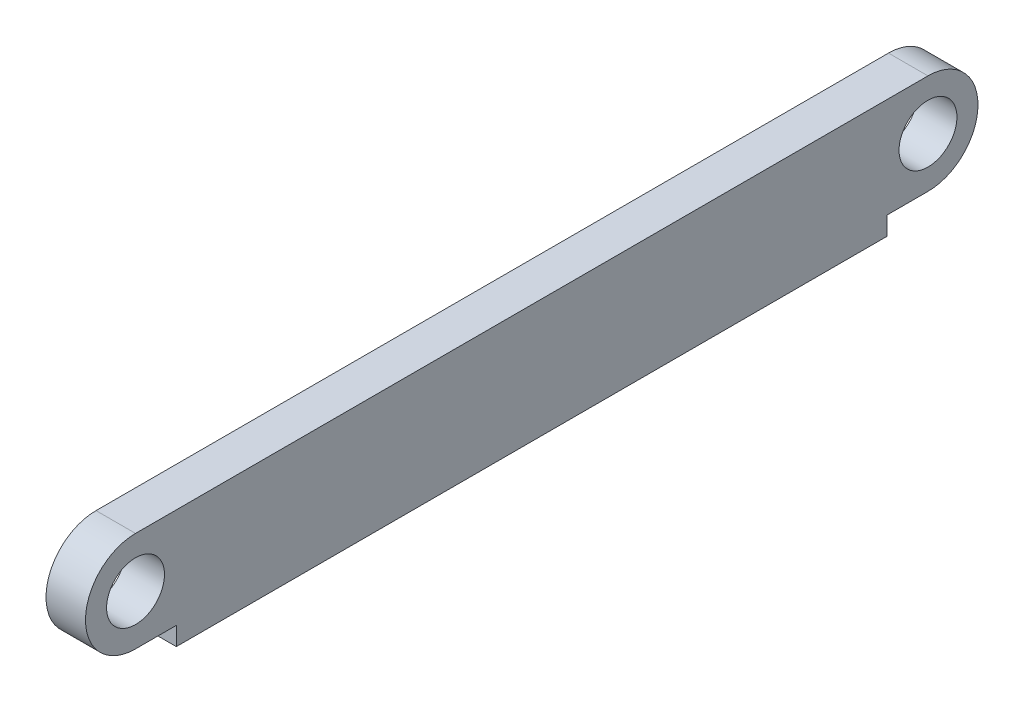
ISO-10303-21;
HEADER;
FILE_DESCRIPTION(('STEP AP214'),'2;1');
FILE_NAME('part.step','',(''),(''),'','','');
FILE_SCHEMA(('AUTOMOTIVE_DESIGN { 1 0 10303 214 1 1 1 1 }'));
ENDSEC;
DATA;
#1=APPLICATION_CONTEXT('core data for automotive mechanical design processes');
#2=APPLICATION_PROTOCOL_DEFINITION('international standard','automotive_design',2000,#1);
#3=PRODUCT_CONTEXT('',#1,'mechanical');
#4=PRODUCT('Part','Part','',(#3));
#5=PRODUCT_RELATED_PRODUCT_CATEGORY('part','',(#4));
#6=PRODUCT_DEFINITION_FORMATION('','',#4);
#7=PRODUCT_DEFINITION_CONTEXT('part definition',#1,'design');
#8=PRODUCT_DEFINITION('design','',#6,#7);
#9=PRODUCT_DEFINITION_SHAPE('','',#8);
#10=(LENGTH_UNIT() NAMED_UNIT(*) SI_UNIT(.MILLI.,.METRE.));
#11=(NAMED_UNIT(*) PLANE_ANGLE_UNIT() SI_UNIT($,.RADIAN.));
#12=(NAMED_UNIT(*) SI_UNIT($,.STERADIAN.) SOLID_ANGLE_UNIT());
#13=UNCERTAINTY_MEASURE_WITH_UNIT(LENGTH_MEASURE(1.E-05),#10,'distance_accuracy_value','');
#14=(GEOMETRIC_REPRESENTATION_CONTEXT(3) GLOBAL_UNCERTAINTY_ASSIGNED_CONTEXT((#13)) GLOBAL_UNIT_ASSIGNED_CONTEXT((#10,
#11,#12)) REPRESENTATION_CONTEXT('',''));
#15=CARTESIAN_POINT('',(0.,0.,0.));
#16=DIRECTION('',(0.,0.,1.));
#17=DIRECTION('',(1.,0.,0.));
#18=AXIS2_PLACEMENT_3D('',#15,#16,#17);
#19=CARTESIAN_POINT('',(3.,-5.50000000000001,-35.5));
#20=DIRECTION('',(0.,0.,1.));
#21=DIRECTION('',(1.,0.,0.));
#22=AXIS2_PLACEMENT_3D('',#19,#20,#21);
#23=PLANE('',#22);
#24=DIRECTION('',(-1.,0.,0.));
#25=VECTOR('',#24,1.);
#26=CARTESIAN_POINT('',(3.,-4.1,-35.5));
#27=LINE('',#26,#25);
#28=CARTESIAN_POINT('',(3.,-4.1,-35.5));
#29=VERTEX_POINT('',#28);
#30=CARTESIAN_POINT('',(0.,-4.1,-35.5));
#31=VERTEX_POINT('',#30);
#32=EDGE_CURVE('E56',#29,#31,#27,.T.);
#33=ORIENTED_EDGE('',*,*,#32,.F.);
#34=DIRECTION('',(0.,1.,0.));
#35=VECTOR('',#34,1.);
#36=CARTESIAN_POINT('',(3.,-5.50000000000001,-35.5));
#37=LINE('',#36,#35);
#38=CARTESIAN_POINT('',(3.,-5.50000000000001,-35.5));
#39=VERTEX_POINT('',#38);
#40=EDGE_CURVE('E217',#39,#29,#37,.T.);
#41=ORIENTED_EDGE('',*,*,#40,.F.);
#42=DIRECTION('',(-1.,0.,0.));
#43=VECTOR('',#42,1.);
#44=CARTESIAN_POINT('',(3.,-5.50000000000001,-35.5));
#45=LINE('',#44,#43);
#46=CARTESIAN_POINT('',(0.,-5.50000000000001,-35.5));
#47=VERTEX_POINT('',#46);
#48=EDGE_CURVE('E41',#39,#47,#45,.T.);
#49=ORIENTED_EDGE('',*,*,#48,.T.);
#50=DIRECTION('',(0.,1.,0.));
#51=VECTOR('',#50,1.);
#52=CARTESIAN_POINT('',(0.,-5.50000000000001,-35.5));
#53=LINE('',#52,#51);
#54=EDGE_CURVE('E224',#47,#31,#53,.T.);
#55=ORIENTED_EDGE('',*,*,#54,.T.);
#56=EDGE_LOOP('',(#33,#41,#49,#55));
#57=FACE_BOUND('',#56,.T.);
#58=ADVANCED_FACE('F33',(#57),#23,.F.);
#59=CARTESIAN_POINT('',(3.,3.5,18.5));
#60=DIRECTION('',(0.,0.,-1.));
#61=DIRECTION('',(-1.,0.,0.));
#62=AXIS2_PLACEMENT_3D('',#59,#60,#61);
#63=PLANE('',#62);
#64=DIRECTION('',(1.,0.,0.));
#65=VECTOR('',#64,1.);
#66=CARTESIAN_POINT('',(3.,-4.1,18.5));
#67=LINE('',#66,#65);
#68=CARTESIAN_POINT('',(0.,-4.1,18.5));
#69=VERTEX_POINT('',#68);
#70=CARTESIAN_POINT('',(3.,-4.1,18.5));
#71=VERTEX_POINT('',#70);
#72=EDGE_CURVE('E208',#69,#71,#67,.T.);
#73=ORIENTED_EDGE('',*,*,#72,.F.);
#74=DIRECTION('',(0.,-1.,0.));
#75=VECTOR('',#74,1.);
#76=CARTESIAN_POINT('',(0.,3.5,18.5));
#77=LINE('',#76,#75);
#78=CARTESIAN_POINT('',(0.,-5.50000000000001,18.5));
#79=VERTEX_POINT('',#78);
#80=EDGE_CURVE('E211',#69,#79,#77,.T.);
#81=ORIENTED_EDGE('',*,*,#80,.T.);
#82=DIRECTION('',(-1.,0.,0.));
#83=VECTOR('',#82,1.);
#84=CARTESIAN_POINT('',(3.,-5.50000000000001,18.5));
#85=LINE('',#84,#83);
#86=CARTESIAN_POINT('',(3.,-5.50000000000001,18.5));
#87=VERTEX_POINT('',#86);
#88=EDGE_CURVE('E11',#87,#79,#85,.T.);
#89=ORIENTED_EDGE('',*,*,#88,.F.);
#90=DIRECTION('',(0.,-1.,0.));
#91=VECTOR('',#90,1.);
#92=CARTESIAN_POINT('',(3.,3.5,18.5));
#93=LINE('',#92,#91);
#94=EDGE_CURVE('E212',#71,#87,#93,.T.);
#95=ORIENTED_EDGE('',*,*,#94,.F.);
#96=EDGE_LOOP('',(#73,#81,#89,#95));
#97=FACE_BOUND('',#96,.T.);
#98=ADVANCED_FACE('F35',(#97),#63,.F.);
#99=CARTESIAN_POINT('',(3.,-5.50000000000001,18.5));
#100=DIRECTION('',(0.,1.,0.));
#101=DIRECTION('',(0.,0.,1.));
#102=AXIS2_PLACEMENT_3D('',#99,#100,#101);
#103=PLANE('',#102);
#104=DIRECTION('',(0.,0.,-1.));
#105=VECTOR('',#104,1.);
#106=CARTESIAN_POINT('',(0.,-5.50000000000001,18.5));
#107=LINE('',#106,#105);
#108=EDGE_CURVE('E222',#79,#47,#107,.T.);
#109=ORIENTED_EDGE('',*,*,#108,.T.);
#110=ORIENTED_EDGE('',*,*,#48,.F.);
#111=DIRECTION('',(0.,0.,-1.));
#112=VECTOR('',#111,1.);
#113=CARTESIAN_POINT('',(3.,-5.50000000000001,18.5));
#114=LINE('',#113,#112);
#115=EDGE_CURVE('E214',#87,#39,#114,.T.);
#116=ORIENTED_EDGE('',*,*,#115,.F.);
#117=ORIENTED_EDGE('',*,*,#88,.T.);
#118=EDGE_LOOP('',(#109,#110,#116,#117));
#119=FACE_BOUND('',#118,.T.);
#120=ADVANCED_FACE('F249',(#119),#103,.F.);
#121=CARTESIAN_POINT('',(3.,3.5,18.5));
#122=DIRECTION('',(0.,-1.,0.));
#123=DIRECTION('',(0.,0.,-1.));
#124=AXIS2_PLACEMENT_3D('',#121,#122,#123);
#125=PLANE('',#124);
#126=DIRECTION('',(0.,0.,1.));
#127=VECTOR('',#126,1.);
#128=CARTESIAN_POINT('',(0.,3.5,18.5));
#129=LINE('',#128,#127);
#130=CARTESIAN_POINT('',(0.,3.5,-38.6));
#131=VERTEX_POINT('',#130);
#132=CARTESIAN_POINT('',(0.,3.5,21.6));
#133=VERTEX_POINT('',#132);
#134=EDGE_CURVE('E215',#131,#133,#129,.T.);
#135=ORIENTED_EDGE('',*,*,#134,.T.);
#136=DIRECTION('',(-1.,0.,0.));
#137=VECTOR('',#136,1.);
#138=CARTESIAN_POINT('',(3.,3.5,21.6));
#139=LINE('',#138,#137);
#140=CARTESIAN_POINT('',(3.,3.5,21.6));
#141=VERTEX_POINT('',#140);
#142=EDGE_CURVE('E198',#141,#133,#139,.T.);
#143=ORIENTED_EDGE('',*,*,#142,.F.);
#144=DIRECTION('',(0.,0.,1.));
#145=VECTOR('',#144,1.);
#146=CARTESIAN_POINT('',(3.,3.5,18.5));
#147=LINE('',#146,#145);
#148=CARTESIAN_POINT('',(3.,3.5,-38.6));
#149=VERTEX_POINT('',#148);
#150=EDGE_CURVE('E219',#149,#141,#147,.T.);
#151=ORIENTED_EDGE('',*,*,#150,.F.);
#152=DIRECTION('',(-1.,0.,0.));
#153=VECTOR('',#152,1.);
#154=CARTESIAN_POINT('',(3.,3.5,-38.6));
#155=LINE('',#154,#153);
#156=EDGE_CURVE('E180',#149,#131,#155,.T.);
#157=ORIENTED_EDGE('',*,*,#156,.T.);
#158=EDGE_LOOP('',(#135,#143,#151,#157));
#159=FACE_BOUND('',#158,.T.);
#160=ADVANCED_FACE('F259',(#159),#125,.F.);
#161=CARTESIAN_POINT('',(3.,0.,0.));
#162=DIRECTION('',(1.,0.,0.));
#163=DIRECTION('',(0.,0.,-1.));
#164=AXIS2_PLACEMENT_3D('',#161,#162,#163);
#165=PLANE('',#164);
#166=CARTESIAN_POINT('',(3.,-0.299999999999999,21.6));
#167=DIRECTION('',(1.,0.,0.));
#168=DIRECTION('',(0.,0.,-1.));
#169=AXIS2_PLACEMENT_3D('',#166,#167,#168);
#170=CIRCLE('',#169,2.2);
#171=CARTESIAN_POINT('',(3.,-0.299999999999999,19.4));
#172=VERTEX_POINT('',#171);
#173=EDGE_CURVE('E166',#172,#172,#170,.T.);
#174=ORIENTED_EDGE('',*,*,#173,.F.);
#175=EDGE_LOOP('',(#174));
#176=FACE_BOUND('',#175,.T.);
#177=CARTESIAN_POINT('',(3.,-0.299999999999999,-38.6));
#178=DIRECTION('',(1.,0.,0.));
#179=DIRECTION('',(0.,0.,-1.));
#180=AXIS2_PLACEMENT_3D('',#177,#178,#179);
#181=CIRCLE('',#180,2.2);
#182=CARTESIAN_POINT('',(3.,-0.299999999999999,-40.8));
#183=VERTEX_POINT('',#182);
#184=EDGE_CURVE('E158',#183,#183,#181,.T.);
#185=ORIENTED_EDGE('',*,*,#184,.F.);
#186=EDGE_LOOP('',(#185));
#187=FACE_BOUND('',#186,.T.);
#188=ORIENTED_EDGE('',*,*,#150,.T.);
#189=CARTESIAN_POINT('',(3.,-0.299999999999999,21.6));
#190=DIRECTION('',(1.,0.,0.));
#191=DIRECTION('',(0.,0.,-1.));
#192=AXIS2_PLACEMENT_3D('',#189,#190,#191);
#193=CIRCLE('',#192,3.8);
#194=CARTESIAN_POINT('',(3.,-4.1,21.6));
#195=VERTEX_POINT('',#194);
#196=EDGE_CURVE('E191',#141,#195,#193,.T.);
#197=ORIENTED_EDGE('',*,*,#196,.T.);
#198=DIRECTION('',(0.,0.,-1.));
#199=VECTOR('',#198,1.);
#200=CARTESIAN_POINT('',(3.,-4.1,21.6));
#201=LINE('',#200,#199);
#202=EDGE_CURVE('E194',#195,#71,#201,.T.);
#203=ORIENTED_EDGE('',*,*,#202,.T.);
#204=ORIENTED_EDGE('',*,*,#94,.T.);
#205=ORIENTED_EDGE('',*,*,#115,.T.);
#206=ORIENTED_EDGE('',*,*,#40,.T.);
#207=DIRECTION('',(0.,0.,-1.));
#208=VECTOR('',#207,1.);
#209=CARTESIAN_POINT('',(3.,-4.1,-35.2));
#210=LINE('',#209,#208);
#211=CARTESIAN_POINT('',(3.,-4.1,-38.6));
#212=VERTEX_POINT('',#211);
#213=EDGE_CURVE('E174',#29,#212,#210,.T.);
#214=ORIENTED_EDGE('',*,*,#213,.T.);
#215=CARTESIAN_POINT('',(3.,-0.299999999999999,-38.6));
#216=DIRECTION('',(1.,0.,0.));
#217=DIRECTION('',(0.,0.,-1.));
#218=AXIS2_PLACEMENT_3D('',#215,#216,#217);
#219=CIRCLE('',#218,3.8);
#220=EDGE_CURVE('E176',#212,#149,#219,.T.);
#221=ORIENTED_EDGE('',*,*,#220,.T.);
#222=EDGE_LOOP('',(#188,#197,#203,#204,#205,#206,#214,#221));
#223=FACE_BOUND('',#222,.T.);
#224=ADVANCED_FACE('F246',(#176,#187,#223),#165,.T.);
#225=CARTESIAN_POINT('',(0.,0.,0.));
#226=DIRECTION('',(1.,0.,0.));
#227=DIRECTION('',(0.,0.,-1.));
#228=AXIS2_PLACEMENT_3D('',#225,#226,#227);
#229=PLANE('',#228);
#230=DIRECTION('',(0.,0.,1.));
#231=VECTOR('',#230,1.);
#232=CARTESIAN_POINT('',(0.,-4.75000000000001,-34.5));
#233=LINE('',#232,#231);
#234=CARTESIAN_POINT('',(0.,-4.75000000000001,-34.5));
#235=VERTEX_POINT('',#234);
#236=CARTESIAN_POINT('',(0.,-4.75000000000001,17.5));
#237=VERTEX_POINT('',#236);
#238=EDGE_CURVE('E152',#235,#237,#233,.T.);
#239=ORIENTED_EDGE('',*,*,#238,.F.);
#240=DIRECTION('',(0.,-1.,0.));
#241=VECTOR('',#240,1.);
#242=CARTESIAN_POINT('',(0.,-4.75000000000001,-34.5));
#243=LINE('',#242,#241);
#244=CARTESIAN_POINT('',(0.,2.75,-34.5));
#245=VERTEX_POINT('',#244);
#246=EDGE_CURVE('E48',#245,#235,#243,.T.);
#247=ORIENTED_EDGE('',*,*,#246,.F.);
#248=DIRECTION('',(0.,0.,-1.));
#249=VECTOR('',#248,1.);
#250=CARTESIAN_POINT('',(0.,2.75,-34.5));
#251=LINE('',#250,#249);
#252=CARTESIAN_POINT('',(0.,2.75,17.5));
#253=VERTEX_POINT('',#252);
#254=EDGE_CURVE('E143',#253,#245,#251,.T.);
#255=ORIENTED_EDGE('',*,*,#254,.F.);
#256=DIRECTION('',(0.,1.,0.));
#257=VECTOR('',#256,1.);
#258=CARTESIAN_POINT('',(0.,-4.75000000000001,17.5));
#259=LINE('',#258,#257);
#260=EDGE_CURVE('E146',#237,#253,#259,.T.);
#261=ORIENTED_EDGE('',*,*,#260,.F.);
#262=EDGE_LOOP('',(#239,#247,#255,#261));
#263=FACE_BOUND('',#262,.T.);
#264=CARTESIAN_POINT('',(0.,-0.299999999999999,21.6));
#265=DIRECTION('',(1.,0.,0.));
#266=DIRECTION('',(0.,0.,-1.));
#267=AXIS2_PLACEMENT_3D('',#264,#265,#266);
#268=CIRCLE('',#267,2.2);
#269=CARTESIAN_POINT('',(0.,-0.299999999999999,19.4));
#270=VERTEX_POINT('',#269);
#271=EDGE_CURVE('E162',#270,#270,#268,.T.);
#272=ORIENTED_EDGE('',*,*,#271,.T.);
#273=EDGE_LOOP('',(#272));
#274=FACE_BOUND('',#273,.T.);
#275=CARTESIAN_POINT('',(0.,-0.299999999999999,-38.6));
#276=DIRECTION('',(1.,0.,0.));
#277=DIRECTION('',(0.,0.,-1.));
#278=AXIS2_PLACEMENT_3D('',#275,#276,#277);
#279=CIRCLE('',#278,2.2);
#280=CARTESIAN_POINT('',(0.,-0.299999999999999,-40.8));
#281=VERTEX_POINT('',#280);
#282=EDGE_CURVE('E169',#281,#281,#279,.T.);
#283=ORIENTED_EDGE('',*,*,#282,.T.);
#284=EDGE_LOOP('',(#283));
#285=FACE_BOUND('',#284,.T.);
#286=CARTESIAN_POINT('',(0.,-0.299999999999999,21.6));
#287=DIRECTION('',(1.,0.,0.));
#288=DIRECTION('',(0.,0.,-1.));
#289=AXIS2_PLACEMENT_3D('',#286,#287,#288);
#290=CIRCLE('',#289,3.8);
#291=CARTESIAN_POINT('',(0.,-4.1,21.6));
#292=VERTEX_POINT('',#291);
#293=EDGE_CURVE('E190',#133,#292,#290,.T.);
#294=ORIENTED_EDGE('',*,*,#293,.F.);
#295=ORIENTED_EDGE('',*,*,#134,.F.);
#296=CARTESIAN_POINT('',(0.,-0.299999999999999,-38.6));
#297=DIRECTION('',(1.,0.,0.));
#298=DIRECTION('',(0.,0.,-1.));
#299=AXIS2_PLACEMENT_3D('',#296,#297,#298);
#300=CIRCLE('',#299,3.8);
#301=CARTESIAN_POINT('',(0.,-4.1,-38.6));
#302=VERTEX_POINT('',#301);
#303=EDGE_CURVE('E177',#302,#131,#300,.T.);
#304=ORIENTED_EDGE('',*,*,#303,.F.);
#305=DIRECTION('',(0.,0.,-1.));
#306=VECTOR('',#305,1.);
#307=CARTESIAN_POINT('',(0.,-4.1,-35.2));
#308=LINE('',#307,#306);
#309=EDGE_CURVE('E165',#31,#302,#308,.T.);
#310=ORIENTED_EDGE('',*,*,#309,.F.);
#311=ORIENTED_EDGE('',*,*,#54,.F.);
#312=ORIENTED_EDGE('',*,*,#108,.F.);
#313=ORIENTED_EDGE('',*,*,#80,.F.);
#314=DIRECTION('',(0.,0.,-1.));
#315=VECTOR('',#314,1.);
#316=CARTESIAN_POINT('',(0.,-4.1,21.6));
#317=LINE('',#316,#315);
#318=EDGE_CURVE('E195',#292,#69,#317,.T.);
#319=ORIENTED_EDGE('',*,*,#318,.F.);
#320=EDGE_LOOP('',(#294,#295,#304,#310,#311,#312,#313,#319));
#321=FACE_BOUND('',#320,.T.);
#322=ADVANCED_FACE('F235',(#263,#274,#285,#321),#229,.F.);
#323=CARTESIAN_POINT('',(3.,-4.1,21.6));
#324=DIRECTION('',(0.,1.,0.));
#325=DIRECTION('',(0.,0.,1.));
#326=AXIS2_PLACEMENT_3D('',#323,#324,#325);
#327=PLANE('',#326);
#328=ORIENTED_EDGE('',*,*,#318,.T.);
#329=ORIENTED_EDGE('',*,*,#72,.T.);
#330=ORIENTED_EDGE('',*,*,#202,.F.);
#331=DIRECTION('',(-1.,0.,0.));
#332=VECTOR('',#331,1.);
#333=CARTESIAN_POINT('',(3.,-4.1,21.6));
#334=LINE('',#333,#332);
#335=EDGE_CURVE('E205',#195,#292,#334,.T.);
#336=ORIENTED_EDGE('',*,*,#335,.T.);
#337=EDGE_LOOP('',(#328,#329,#330,#336));
#338=FACE_BOUND('',#337,.T.);
#339=ADVANCED_FACE('F254',(#338),#327,.F.);
#340=CARTESIAN_POINT('',(3.,-0.299999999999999,21.6));
#341=DIRECTION('',(-1.,0.,0.));
#342=DIRECTION('',(0.,0.,1.));
#343=AXIS2_PLACEMENT_3D('',#340,#341,#342);
#344=CYLINDRICAL_SURFACE('',#343,3.8);
#345=ORIENTED_EDGE('',*,*,#293,.T.);
#346=ORIENTED_EDGE('',*,*,#335,.F.);
#347=ORIENTED_EDGE('',*,*,#196,.F.);
#348=ORIENTED_EDGE('',*,*,#142,.T.);
#349=EDGE_LOOP('',(#345,#346,#347,#348));
#350=FACE_BOUND('',#349,.T.);
#351=ADVANCED_FACE('F257',(#350),#344,.T.);
#352=CARTESIAN_POINT('',(3.,-4.1,-35.2));
#353=DIRECTION('',(0.,1.,0.));
#354=DIRECTION('',(0.,0.,1.));
#355=AXIS2_PLACEMENT_3D('',#352,#353,#354);
#356=PLANE('',#355);
#357=ORIENTED_EDGE('',*,*,#213,.F.);
#358=ORIENTED_EDGE('',*,*,#32,.T.);
#359=ORIENTED_EDGE('',*,*,#309,.T.);
#360=DIRECTION('',(-1.,0.,0.));
#361=VECTOR('',#360,1.);
#362=CARTESIAN_POINT('',(3.,-4.1,-38.6));
#363=LINE('',#362,#361);
#364=EDGE_CURVE('E186',#212,#302,#363,.T.);
#365=ORIENTED_EDGE('',*,*,#364,.F.);
#366=EDGE_LOOP('',(#357,#358,#359,#365));
#367=FACE_BOUND('',#366,.T.);
#368=ADVANCED_FACE('F240',(#367),#356,.F.);
#369=CARTESIAN_POINT('',(3.,-0.299999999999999,-38.6));
#370=DIRECTION('',(-1.,0.,0.));
#371=DIRECTION('',(0.,0.,1.));
#372=AXIS2_PLACEMENT_3D('',#369,#370,#371);
#373=CYLINDRICAL_SURFACE('',#372,3.8);
#374=ORIENTED_EDGE('',*,*,#303,.T.);
#375=ORIENTED_EDGE('',*,*,#156,.F.);
#376=ORIENTED_EDGE('',*,*,#220,.F.);
#377=ORIENTED_EDGE('',*,*,#364,.T.);
#378=EDGE_LOOP('',(#374,#375,#376,#377));
#379=FACE_BOUND('',#378,.T.);
#380=ADVANCED_FACE('F243',(#379),#373,.T.);
#381=CARTESIAN_POINT('',(0.,-0.299999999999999,-38.6));
#382=DIRECTION('',(1.,0.,0.));
#383=DIRECTION('',(0.,0.,-1.));
#384=AXIS2_PLACEMENT_3D('',#381,#382,#383);
#385=CYLINDRICAL_SURFACE('',#384,2.2);
#386=ORIENTED_EDGE('',*,*,#282,.F.);
#387=EDGE_LOOP('',(#386));
#388=FACE_BOUND('',#387,.T.);
#389=ORIENTED_EDGE('',*,*,#184,.T.);
#390=EDGE_LOOP('',(#389));
#391=FACE_BOUND('',#390,.T.);
#392=ADVANCED_FACE('F354',(#388,#391),#385,.F.);
#393=CARTESIAN_POINT('',(0.,-0.299999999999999,21.6));
#394=DIRECTION('',(1.,0.,0.));
#395=DIRECTION('',(0.,0.,-1.));
#396=AXIS2_PLACEMENT_3D('',#393,#394,#395);
#397=CYLINDRICAL_SURFACE('',#396,2.2);
#398=ORIENTED_EDGE('',*,*,#271,.F.);
#399=EDGE_LOOP('',(#398));
#400=FACE_BOUND('',#399,.T.);
#401=ORIENTED_EDGE('',*,*,#173,.T.);
#402=EDGE_LOOP('',(#401));
#403=FACE_BOUND('',#402,.T.);
#404=ADVANCED_FACE('F361',(#400,#403),#397,.F.);
#405=CARTESIAN_POINT('',(0.75,-4.75000000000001,-34.5));
#406=DIRECTION('',(0.,0.,-1.));
#407=DIRECTION('',(-1.,0.,0.));
#408=AXIS2_PLACEMENT_3D('',#405,#406,#407);
#409=PLANE('',#408);
#410=ORIENTED_EDGE('',*,*,#246,.T.);
#411=DIRECTION('',(-1.,0.,0.));
#412=VECTOR('',#411,1.);
#413=CARTESIAN_POINT('',(0.75,-4.75000000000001,-34.5));
#414=LINE('',#413,#412);
#415=CARTESIAN_POINT('',(0.75,-4.75000000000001,-34.5));
#416=VERTEX_POINT('',#415);
#417=EDGE_CURVE('E121',#416,#235,#414,.T.);
#418=ORIENTED_EDGE('',*,*,#417,.F.);
#419=DIRECTION('',(0.,-1.,0.));
#420=VECTOR('',#419,1.);
#421=CARTESIAN_POINT('',(0.75,-4.75000000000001,-34.5));
#422=LINE('',#421,#420);
#423=CARTESIAN_POINT('',(0.75,2.75,-34.5));
#424=VERTEX_POINT('',#423);
#425=EDGE_CURVE('E125',#424,#416,#422,.T.);
#426=ORIENTED_EDGE('',*,*,#425,.F.);
#427=DIRECTION('',(-1.,0.,0.));
#428=VECTOR('',#427,1.);
#429=CARTESIAN_POINT('',(0.75,2.75,-34.5));
#430=LINE('',#429,#428);
#431=EDGE_CURVE('E156',#424,#245,#430,.T.);
#432=ORIENTED_EDGE('',*,*,#431,.T.);
#433=EDGE_LOOP('',(#410,#418,#426,#432));
#434=FACE_BOUND('',#433,.T.);
#435=ADVANCED_FACE('F123',(#434),#409,.F.);
#436=CARTESIAN_POINT('',(0.75,2.75,-34.5));
#437=DIRECTION('',(0.,1.,0.));
#438=DIRECTION('',(0.,0.,1.));
#439=AXIS2_PLACEMENT_3D('',#436,#437,#438);
#440=PLANE('',#439);
#441=ORIENTED_EDGE('',*,*,#254,.T.);
#442=ORIENTED_EDGE('',*,*,#431,.F.);
#443=DIRECTION('',(0.,0.,-1.));
#444=VECTOR('',#443,1.);
#445=CARTESIAN_POINT('',(0.75,2.75,-34.5));
#446=LINE('',#445,#444);
#447=CARTESIAN_POINT('',(0.75,2.75,17.5));
#448=VERTEX_POINT('',#447);
#449=EDGE_CURVE('E131',#448,#424,#446,.T.);
#450=ORIENTED_EDGE('',*,*,#449,.F.);
#451=DIRECTION('',(-1.,0.,0.));
#452=VECTOR('',#451,1.);
#453=CARTESIAN_POINT('',(0.75,2.75,17.5));
#454=LINE('',#453,#452);
#455=EDGE_CURVE('E159',#448,#253,#454,.T.);
#456=ORIENTED_EDGE('',*,*,#455,.T.);
#457=EDGE_LOOP('',(#441,#442,#450,#456));
#458=FACE_BOUND('',#457,.T.);
#459=ADVANCED_FACE('F376',(#458),#440,.F.);
#460=CARTESIAN_POINT('',(0.75,-4.75000000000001,17.5));
#461=DIRECTION('',(0.,0.,1.));
#462=DIRECTION('',(1.,0.,0.));
#463=AXIS2_PLACEMENT_3D('',#460,#461,#462);
#464=PLANE('',#463);
#465=ORIENTED_EDGE('',*,*,#260,.T.);
#466=ORIENTED_EDGE('',*,*,#455,.F.);
#467=DIRECTION('',(0.,1.,0.));
#468=VECTOR('',#467,1.);
#469=CARTESIAN_POINT('',(0.75,-4.75000000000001,17.5));
#470=LINE('',#469,#468);
#471=CARTESIAN_POINT('',(0.75,-4.75000000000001,17.5));
#472=VERTEX_POINT('',#471);
#473=EDGE_CURVE('E139',#472,#448,#470,.T.);
#474=ORIENTED_EDGE('',*,*,#473,.F.);
#475=DIRECTION('',(-1.,0.,0.));
#476=VECTOR('',#475,1.);
#477=CARTESIAN_POINT('',(0.75,-4.75000000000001,17.5));
#478=LINE('',#477,#476);
#479=EDGE_CURVE('E130',#472,#237,#478,.T.);
#480=ORIENTED_EDGE('',*,*,#479,.T.);
#481=EDGE_LOOP('',(#465,#466,#474,#480));
#482=FACE_BOUND('',#481,.T.);
#483=ADVANCED_FACE('F384',(#482),#464,.F.);
#484=CARTESIAN_POINT('',(0.75,-4.75000000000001,-34.5));
#485=DIRECTION('',(0.,-1.,0.));
#486=DIRECTION('',(0.,0.,-1.));
#487=AXIS2_PLACEMENT_3D('',#484,#485,#486);
#488=PLANE('',#487);
#489=ORIENTED_EDGE('',*,*,#238,.T.);
#490=ORIENTED_EDGE('',*,*,#479,.F.);
#491=DIRECTION('',(0.,0.,1.));
#492=VECTOR('',#491,1.);
#493=CARTESIAN_POINT('',(0.75,-4.75000000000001,-34.5));
#494=LINE('',#493,#492);
#495=EDGE_CURVE('E134',#416,#472,#494,.T.);
#496=ORIENTED_EDGE('',*,*,#495,.F.);
#497=ORIENTED_EDGE('',*,*,#417,.T.);
#498=EDGE_LOOP('',(#489,#490,#496,#497));
#499=FACE_BOUND('',#498,.T.);
#500=ADVANCED_FACE('F135',(#499),#488,.F.);
#501=CARTESIAN_POINT('',(0.75,0.,0.));
#502=DIRECTION('',(1.,0.,0.));
#503=DIRECTION('',(0.,0.,-1.));
#504=AXIS2_PLACEMENT_3D('',#501,#502,#503);
#505=PLANE('',#504);
#506=ORIENTED_EDGE('',*,*,#425,.T.);
#507=ORIENTED_EDGE('',*,*,#495,.T.);
#508=ORIENTED_EDGE('',*,*,#473,.T.);
#509=ORIENTED_EDGE('',*,*,#449,.T.);
#510=EDGE_LOOP('',(#506,#507,#508,#509));
#511=FACE_BOUND('',#510,.T.);
#512=ADVANCED_FACE('F141',(#511),#505,.F.);
#513=CLOSED_SHELL('',(#58,#98,#120,#160,#224,#322,#339,#351,#368,#380,#392,#404,#435,#459,#483,
#500,#512));
#514=MANIFOLD_SOLID_BREP('B2',#513);
#515=ADVANCED_BREP_SHAPE_REPRESENTATION('',(#18,#514),#14);
#516=SHAPE_DEFINITION_REPRESENTATION(#9,#515);
ENDSEC;
END-ISO-10303-21;
